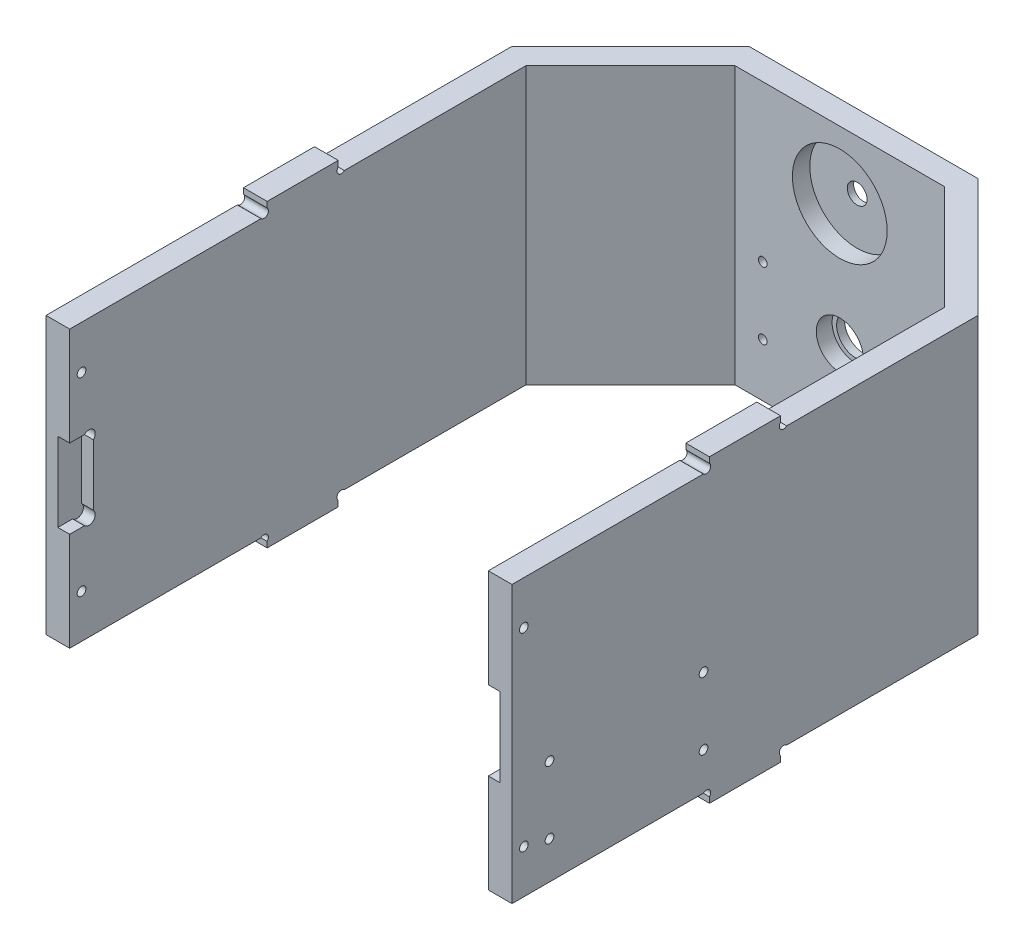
from build123d import *

# Parameters (mm, degrees)
BOSS_EXTRU_1_DEPTH      = 76
ESQUISSE3_R             = 4.8
ESQUISSE3_R_2           = 1.1
ESQUISSE3_R_3           = 2.5
ENL_V_MAT_EXTRU_1_DEPTH = 6
ESQUISSE4_R             = 5.95
ENL_V_MAT_EXTRU_2_DEPTH = 4
ENL_V_MAT_EXTRU_3_DEPTH = 56
ESQUISSE7_R             = 1.1
ENL_V_MAT_EXTRU_4_DEPTH = 59
ENL_V_MAT_EXTRU_5_DEPTH = 167.195667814
ESQUISSE9_R             = 12
ENL_V_MAT_EXTRU_6_DEPTH = 4.4
ESQUISSE10_R            = 1.1
ENL_V_MAT_EXTRU_7_DEPTH = 6


with BuildPart() as part:
    # Esquisse1 → Boss.-Extru.1 (new body)
    with BuildSketch(Plane(origin=(0, 0, 0), x_dir=(1, 0, 0), z_dir=(0, 1, 0))):
        Polygon((-59, 59), (-29, 89), (29, 89), (59, 59), (59, -59), (53, -59), (53, 56.514718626), (26.514718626, 83), (-26.514718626, 83), (-53, 56.514718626), (-53, -59), (-59, -59), align=None)
    extrude(amount=BOSS_EXTRU_1_DEPTH)

    # Esquisse3 → Enl_v. mat.-Extru.1 (cut)
    with BuildSketch(Plane.XY.offset(-83)):
        with Locations((0, 25)):
            Circle(ESQUISSE3_R)
        with Locations((19.5, 16.5)):
            Circle(ESQUISSE3_R_2)
        with Locations(Location((19.5, 33.5, 0), (0, 0, 180))):
            Circle(ESQUISSE3_R_2)
        with Locations(Location((-19.5, 16.5, 0), (0, 0, 180))):
            Circle(ESQUISSE3_R_2)
        with Locations((-19.5, 33.5)):
            Circle(ESQUISSE3_R_2)
        with Locations((0, 56)):
            Circle(ESQUISSE3_R_3)
    extrude(amount=-ENL_V_MAT_EXTRU_1_DEPTH, mode=Mode.SUBTRACT)

    # Esquisse4 → Enl_v. mat.-Extru.2 (cut)
    with BuildSketch(Plane.XY.offset(-83)):
        with Locations((0, 25)):
            Circle(ESQUISSE4_R)
    extrude(amount=-ENL_V_MAT_EXTRU_2_DEPTH, mode=Mode.SUBTRACT)

    # Esquisse6 → Enl_v. mat.-Extru.3 (cut, symmetric)
    with BuildSketch(Plane(origin=(0, 0, 0), x_dir=(0, 0, -1), z_dir=(1, 0, 0))):
        with BuildLine():
            Line((-55.2627417, 28), (-59, 28))
            Line((-59, 28), (-59, 48))
            Line((-59, 48), (-55.2627417, 48))
            ThreePointArc((-55.2627417, 48), (-53, 48), (-53, 45.7372583))
            Line((-53, 45.7372583), (-53, 30.2627417))
            ThreePointArc((-53, 30.2627417), (-53, 28), (-55.2627417, 28))
        make_face()
    extrude(amount=ENL_V_MAT_EXTRU_3_DEPTH, both=True, mode=Mode.SUBTRACT)

    # Esquisse7 → Enl_v. mat.-Extru.4 (cut, symmetric)
    with BuildSketch(Plane(origin=(0, 0, 0), x_dir=(0, 0, -1), z_dir=(1, 0, 0))):
        with Locations((-56, 62)):
            Circle(ESQUISSE7_R)
        with Locations((-56, 14)):
            Circle(ESQUISSE7_R)
    extrude(amount=ENL_V_MAT_EXTRU_4_DEPTH, both=True, mode=Mode.SUBTRACT)

    # Esquisse8 → Enl_v. mat.-Extru.5 (cut, through all)
    with BuildSketch(Plane.ZY.offset(59)):
        with BuildLine():
            Line((9, 74.555634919), (9, 76))
            Line((9, 76), (59, 76))
            Line((59, 76), (59, 73))
            Line((59, 73), (10.555634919, 73))
            ThreePointArc((10.555634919, 73), (9, 73), (9, 74.555634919))
        make_face()
        with BuildLine():
            Line((-9, 74.555634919), (-9, 76))
            Line((-9, 76), (-89, 76))
            Line((-89, 76), (-89, 73))
            Line((-89, 73), (-10.555634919, 73))
            ThreePointArc((-10.555634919, 73), (-9, 73), (-9, 74.555634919))
        make_face()
        with BuildLine():
            Line((59, 0), (59, 3))
            Line((59, 3), (10.555634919, 3))
            ThreePointArc((10.555634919, 3), (9, 3), (9, 1.444365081))
            Line((9, 1.444365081), (9, 0))
            Line((9, 0), (59, 0))
        make_face()
        with BuildLine():
            Line((-89, 3), (-10.555634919, 3))
            ThreePointArc((-10.555634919, 3), (-9, 3), (-9, 1.444365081))
            Line((-9, 1.444365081), (-9, 0))
            Line((-9, 0), (-89, 0))
            Line((-89, 0), (-89, 3))
        make_face()
    extrude(amount=-ENL_V_MAT_EXTRU_5_DEPTH, mode=Mode.SUBTRACT)

    # Esquisse9 → Enl_v. mat.-Extru.6 (cut)
    with BuildSketch(Plane.XY.offset(-83)):
        with Locations((0, 56)):
            Circle(ESQUISSE9_R)
    extrude(amount=-ENL_V_MAT_EXTRU_6_DEPTH, mode=Mode.SUBTRACT)

    # Esquisse10 → Enl_v. mat.-Extru.7 (cut)
    with BuildSketch(Plane.ZY.offset(-53)):
        with Locations((10.5, 12.5)):
            Circle(ESQUISSE10_R)
        with Locations(Location((49.5, 12.5, 0), (0, 0, 180))):
            Circle(ESQUISSE10_R)
        with Locations((49.5, 29.5)):
            Circle(ESQUISSE10_R)
        with Locations(Location((10.5, 29.5, 0), (0, 0, 180))):
            Circle(ESQUISSE10_R)
    extrude(amount=-ENL_V_MAT_EXTRU_7_DEPTH, mode=Mode.SUBTRACT)


solid = part.part
